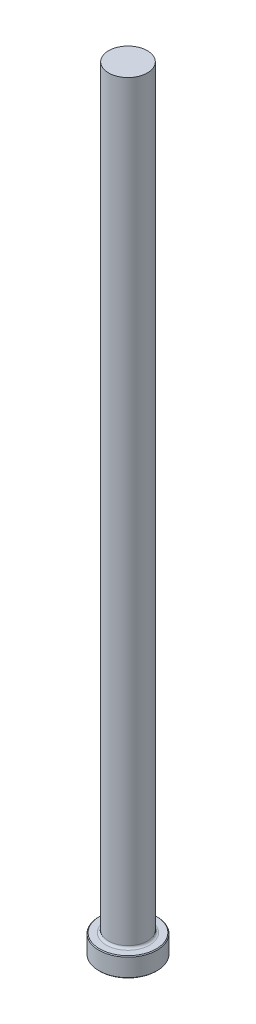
ISO-10303-21;
HEADER;
FILE_DESCRIPTION(('STEP AP214'),'2;1');
FILE_NAME('part.step','',(''),(''),'','','');
FILE_SCHEMA(('AUTOMOTIVE_DESIGN { 1 0 10303 214 1 1 1 1 }'));
ENDSEC;
DATA;
#1=APPLICATION_CONTEXT('core data for automotive mechanical design processes');
#2=APPLICATION_PROTOCOL_DEFINITION('international standard','automotive_design',2000,#1);
#3=PRODUCT_CONTEXT('',#1,'mechanical');
#4=PRODUCT('Part','Part','',(#3));
#5=PRODUCT_RELATED_PRODUCT_CATEGORY('part','',(#4));
#6=PRODUCT_DEFINITION_FORMATION('','',#4);
#7=PRODUCT_DEFINITION_CONTEXT('part definition',#1,'design');
#8=PRODUCT_DEFINITION('design','',#6,#7);
#9=PRODUCT_DEFINITION_SHAPE('','',#8);
#10=(LENGTH_UNIT() NAMED_UNIT(*) SI_UNIT(.MILLI.,.METRE.));
#11=(NAMED_UNIT(*) PLANE_ANGLE_UNIT() SI_UNIT($,.RADIAN.));
#12=(NAMED_UNIT(*) SI_UNIT($,.STERADIAN.) SOLID_ANGLE_UNIT());
#13=UNCERTAINTY_MEASURE_WITH_UNIT(LENGTH_MEASURE(1.E-05),#10,'distance_accuracy_value','');
#14=(GEOMETRIC_REPRESENTATION_CONTEXT(3) GLOBAL_UNCERTAINTY_ASSIGNED_CONTEXT((#13)) GLOBAL_UNIT_ASSIGNED_CONTEXT((#10,
#11,#12)) REPRESENTATION_CONTEXT('',''));
#15=CARTESIAN_POINT('',(0.,0.,0.));
#16=DIRECTION('',(0.,0.,1.));
#17=DIRECTION('',(1.,0.,0.));
#18=AXIS2_PLACEMENT_3D('',#15,#16,#17);
#19=CARTESIAN_POINT('',(0.,0.,0.));
#20=DIRECTION('',(0.,-1.,0.));
#21=DIRECTION('',(0.,0.,-1.));
#22=AXIS2_PLACEMENT_3D('',#19,#20,#21);
#23=PLANE('',#22);
#24=CARTESIAN_POINT('',(0.,0.,0.));
#25=DIRECTION('',(0.,-1.,0.));
#26=DIRECTION('',(0.,0.,-1.));
#27=AXIS2_PLACEMENT_3D('',#24,#25,#26);
#28=CIRCLE('',#27,9.271);
#29=CARTESIAN_POINT('',(0.,0.,-9.271));
#30=VERTEX_POINT('',#29);
#31=EDGE_CURVE('E46',#30,#30,#28,.T.);
#32=ORIENTED_EDGE('',*,*,#31,.T.);
#33=EDGE_LOOP('',(#32));
#34=FACE_BOUND('',#33,.T.);
#35=ADVANCED_FACE('F35',(#34),#23,.T.);
#36=CARTESIAN_POINT('',(0.,259.958771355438,0.));
#37=DIRECTION('',(0.,1.,0.));
#38=DIRECTION('',(0.,0.,1.));
#39=AXIS2_PLACEMENT_3D('',#36,#37,#38);
#40=CYLINDRICAL_SURFACE('',#39,9.52499999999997);
#41=CARTESIAN_POINT('',(0.,6.09600000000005,0.));
#42=DIRECTION('',(0.,1.,0.));
#43=DIRECTION('',(0.,0.,1.));
#44=AXIS2_PLACEMENT_3D('',#41,#42,#43);
#45=CIRCLE('',#44,9.52499999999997);
#46=CARTESIAN_POINT('',(0.,6.09600000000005,9.52499999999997));
#47=VERTEX_POINT('',#46);
#48=EDGE_CURVE('E50',#47,#47,#45,.F.);
#49=ORIENTED_EDGE('',*,*,#48,.T.);
#50=EDGE_LOOP('',(#49));
#51=FACE_BOUND('',#50,.T.);
#52=CARTESIAN_POINT('',(0.,0.253999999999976,0.));
#53=DIRECTION('',(0.,-1.,0.));
#54=DIRECTION('',(0.,0.,-1.));
#55=AXIS2_PLACEMENT_3D('',#52,#53,#54);
#56=CIRCLE('',#55,9.52499999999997);
#57=CARTESIAN_POINT('',(0.,0.253999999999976,-9.52499999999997));
#58=VERTEX_POINT('',#57);
#59=EDGE_CURVE('E55',#58,#58,#56,.F.);
#60=ORIENTED_EDGE('',*,*,#59,.T.);
#61=EDGE_LOOP('',(#60));
#62=FACE_BOUND('',#61,.T.);
#63=ADVANCED_FACE('F77',(#51,#62),#40,.T.);
#64=CARTESIAN_POINT('',(-9.52499999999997,6.35,0.));
#65=DIRECTION('',(0.,1.,0.));
#66=DIRECTION('',(0.,0.,1.));
#67=AXIS2_PLACEMENT_3D('',#64,#65,#66);
#68=PLANE('',#67);
#69=CARTESIAN_POINT('',(0.,6.35,0.));
#70=DIRECTION('',(0.,1.,0.));
#71=DIRECTION('',(0.,0.,1.));
#72=AXIS2_PLACEMENT_3D('',#69,#70,#71);
#73=CIRCLE('',#72,7.11199999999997);
#74=CARTESIAN_POINT('',(0.,6.35,7.11199999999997));
#75=VERTEX_POINT('',#74);
#76=EDGE_CURVE('E10',#75,#75,#73,.F.);
#77=ORIENTED_EDGE('',*,*,#76,.T.);
#78=EDGE_LOOP('',(#77));
#79=FACE_BOUND('',#78,.T.);
#80=CARTESIAN_POINT('',(0.,6.35,0.));
#81=DIRECTION('',(0.,1.,0.));
#82=DIRECTION('',(0.,0.,1.));
#83=AXIS2_PLACEMENT_3D('',#80,#81,#82);
#84=CIRCLE('',#83,9.27100000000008);
#85=CARTESIAN_POINT('',(0.,6.35,9.27100000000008));
#86=VERTEX_POINT('',#85);
#87=EDGE_CURVE('E58',#86,#86,#84,.T.);
#88=ORIENTED_EDGE('',*,*,#87,.T.);
#89=EDGE_LOOP('',(#88));
#90=FACE_BOUND('',#89,.T.);
#91=ADVANCED_FACE('F69',(#79,#90),#68,.T.);
#92=CARTESIAN_POINT('',(0.,259.958771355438,0.));
#93=DIRECTION('',(0.,1.,0.));
#94=DIRECTION('',(0.,0.,1.));
#95=AXIS2_PLACEMENT_3D('',#92,#93,#94);
#96=CYLINDRICAL_SURFACE('',#95,6.34999999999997);
#97=CARTESIAN_POINT('',(0.,7.11200000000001,0.));
#98=DIRECTION('',(0.,1.,0.));
#99=DIRECTION('',(0.,0.,1.));
#100=AXIS2_PLACEMENT_3D('',#97,#98,#99);
#101=CIRCLE('',#100,6.34999999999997);
#102=CARTESIAN_POINT('',(0.,7.11200000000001,6.34999999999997));
#103=VERTEX_POINT('',#102);
#104=EDGE_CURVE('E42',#103,#103,#101,.T.);
#105=ORIENTED_EDGE('',*,*,#104,.T.);
#106=EDGE_LOOP('',(#105));
#107=FACE_BOUND('',#106,.T.);
#108=CARTESIAN_POINT('',(0.,254.,0.));
#109=DIRECTION('',(0.,1.,0.));
#110=DIRECTION('',(0.,0.,1.));
#111=AXIS2_PLACEMENT_3D('',#108,#109,#110);
#112=CIRCLE('',#111,6.34999999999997);
#113=CARTESIAN_POINT('',(0.,254.,6.34999999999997));
#114=VERTEX_POINT('',#113);
#115=EDGE_CURVE('E61',#114,#114,#112,.T.);
#116=ORIENTED_EDGE('',*,*,#115,.F.);
#117=EDGE_LOOP('',(#116));
#118=FACE_BOUND('',#117,.T.);
#119=ADVANCED_FACE('F67',(#107,#118),#96,.T.);
#120=CARTESIAN_POINT('',(-6.34999999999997,254.,0.));
#121=DIRECTION('',(0.,1.,0.));
#122=DIRECTION('',(0.,0.,1.));
#123=AXIS2_PLACEMENT_3D('',#120,#121,#122);
#124=PLANE('',#123);
#125=ORIENTED_EDGE('',*,*,#115,.T.);
#126=EDGE_LOOP('',(#125));
#127=FACE_BOUND('',#126,.T.);
#128=ADVANCED_FACE('F65',(#127),#124,.T.);
#129=CARTESIAN_POINT('',(0.,6.35000000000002,0.));
#130=DIRECTION('',(0.,-1.,0.));
#131=DIRECTION('',(0.,0.,-1.));
#132=AXIS2_PLACEMENT_3D('',#129,#130,#131);
#133=CONICAL_SURFACE('',#132,9.27100000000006,0.785398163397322);
#134=ORIENTED_EDGE('',*,*,#48,.F.);
#135=EDGE_LOOP('',(#134));
#136=FACE_BOUND('',#135,.T.);
#137=ORIENTED_EDGE('',*,*,#87,.F.);
#138=EDGE_LOOP('',(#137));
#139=FACE_BOUND('',#138,.T.);
#140=ADVANCED_FACE('F75',(#136,#139),#133,.T.);
#141=CARTESIAN_POINT('',(0.,0.253999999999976,0.));
#142=DIRECTION('',(0.,1.,0.));
#143=DIRECTION('',(0.,0.,1.));
#144=AXIS2_PLACEMENT_3D('',#141,#142,#143);
#145=CONICAL_SURFACE('',#144,9.52499999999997,0.785398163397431);
#146=ORIENTED_EDGE('',*,*,#31,.F.);
#147=EDGE_LOOP('',(#146));
#148=FACE_BOUND('',#147,.T.);
#149=ORIENTED_EDGE('',*,*,#59,.F.);
#150=EDGE_LOOP('',(#149));
#151=FACE_BOUND('',#150,.T.);
#152=ADVANCED_FACE('F89',(#148,#151),#145,.T.);
#153=CARTESIAN_POINT('',(0.,7.11200000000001,0.));
#154=DIRECTION('',(0.,1.,0.));
#155=DIRECTION('',(0.,0.,1.));
#156=AXIS2_PLACEMENT_3D('',#153,#154,#155);
#157=TOROIDAL_SURFACE('',#156,7.11199999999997,0.762);
#158=ORIENTED_EDGE('',*,*,#76,.F.);
#159=EDGE_LOOP('',(#158));
#160=FACE_BOUND('',#159,.T.);
#161=ORIENTED_EDGE('',*,*,#104,.F.);
#162=EDGE_LOOP('',(#161));
#163=FACE_BOUND('',#162,.T.);
#164=ADVANCED_FACE('F37',(#160,#163),#157,.F.);
#165=CLOSED_SHELL('',(#35,#63,#91,#119,#128,#140,#152,#164));
#166=MANIFOLD_SOLID_BREP('B2',#165);
#167=ADVANCED_BREP_SHAPE_REPRESENTATION('',(#18,#166),#14);
#168=SHAPE_DEFINITION_REPRESENTATION(#9,#167);
ENDSEC;
END-ISO-10303-21;
